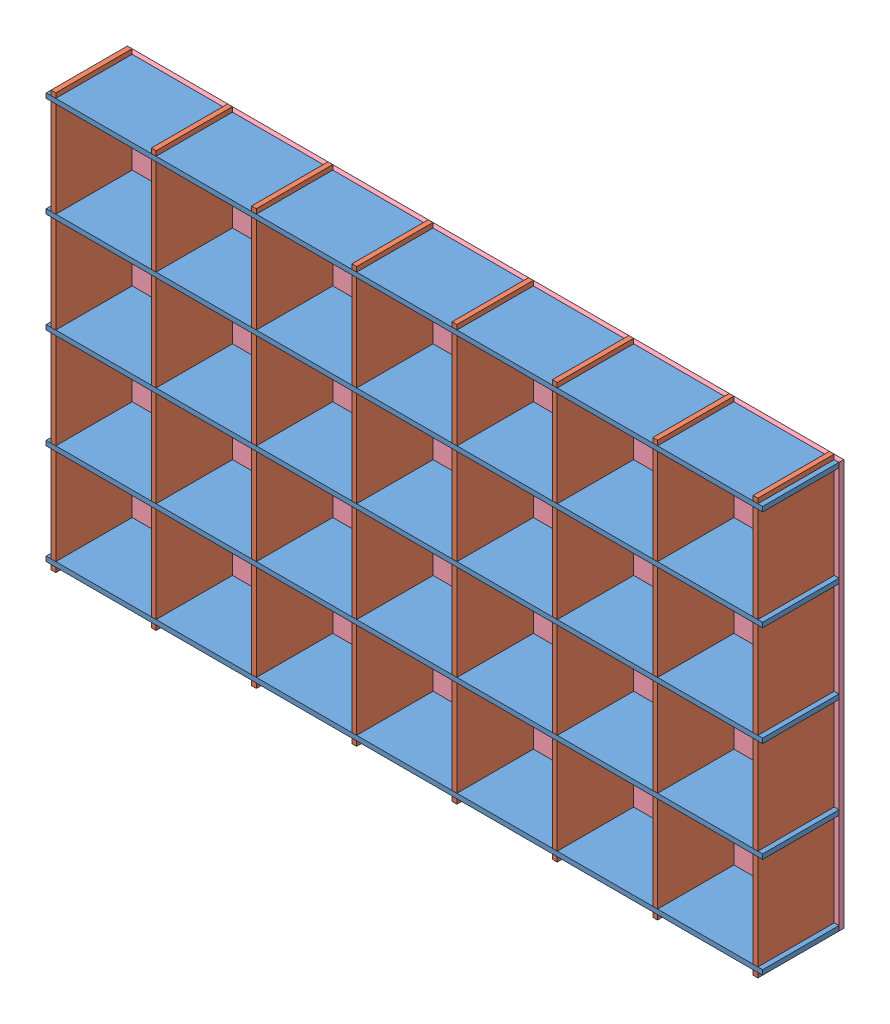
SolidWorks assembly Assem1.sldasm, configuration Default (file format 6000). Lengths in mm.
Overall size (952.5 552.45 107.95).
22 component instances, 4 part files, 3 mates.
Components (placement in the parent):
- shelves-1: shelves.SLDASM [Default] at (360.49 538.3645 700.4575) size (952.5 552.45 107.95)
  - Horizontal-6: Horizontal.SLDPRT [Default] at (-83.5049 678.0016 765.7569) size (952.5 6.35 101.6)
  - Vertical-9: Vertical.SLDPRT [Default] at (-77.1549 -293.5484 664.1569) x (0 1 0) z (1 0 0) size (552.45 101.6 6.35)
  - Vertical-10: Vertical.SLDPRT [Default] at (722.9451 -293.5484 664.1569) x (0 1 0) z (1 0 0) size (552.45 101.6 6.35)
  - Vertical-11: Vertical.SLDPRT [Default] at (456.2451 -293.5484 664.1569) x (0 1 0) z (1 0 0) size (552.45 101.6 6.35)
  - Vertical-12: Vertical.SLDPRT [Default] at (856.2951 -293.5484 664.1569) x (0 1 0) z (1 0 0) size (552.45 101.6 6.35)
  - Vertical-13: Vertical.SLDPRT [Default] at (322.8951 -293.5484 664.1569) x (0 1 0) z (1 0 0) size (552.45 101.6 6.35)
  - Vertical-14: Vertical.SLDPRT [Default] at (189.5451 -293.5484 664.1569) x (0 1 0) z (1 0 0) size (552.45 101.6 6.35)
  - Vertical-15: Vertical.SLDPRT [Default] at (56.1951 -293.5484 664.1569) x (0 1 0) z (1 0 0) size (552.45 101.6 6.35)
  - Vertical-16: Vertical.SLDPRT [Default] at (589.5951 -293.5484 664.1569) x (0 1 0) z (1 0 0) size (552.45 101.6 6.35)
  - Horizontal-7: Horizontal.SLDPRT [Default] at (-83.5049 144.6016 765.7569) size (952.5 6.35 101.6)
  - Horizontal-8: Horizontal.SLDPRT [Default] at (-83.5049 277.9516 765.7569) size (952.5 6.35 101.6)
  - Horizontal-9: Horizontal.SLDPRT [Default] at (-83.5049 411.3016 765.7569) size (952.5 6.35 101.6)
  - Horizontal-10: Horizontal.SLDPRT [Default] at (-83.5049 544.6516 765.7569) size (952.5 6.35 101.6)
  - little support-1: little support.SLDPRT [Default] at (646.7451 671.6515 673.6819) size (25.4 6.35 15.88)
  - little support-2: little support.SLDPRT [Default] at (780.0951 671.6516 673.6819) size (25.4 6.35 15.88)
  - little support-3: little support.SLDPRT [Default] at (246.6951 671.6516 673.6819) size (25.4 6.35 15.88)
  - little support-4: little support.SLDPRT [Default] at (380.0451 671.6515 673.6819) size (25.4 6.35 15.88)
  - little support-5: little support.SLDPRT [Default] at (513.3951 671.6515 673.6819) size (25.4 6.35 15.88)
  - little support-6: little support.SLDPRT [Default] at (113.3451 671.6516 673.6819) size (25.4 6.35 15.88)
  - little support-7: little support.SLDPRT [Default] at (-20.0049 671.6516 673.6819) size (25.4 6.35 15.88)
- complete back-1: complete back.SLDPRT [Default] at (276.9851 682.9661 1358.2644) size (952.5 539.75 6.35)
Mates (geometry in assembly coordinates):
- Coincident1: coincident: plane of shelves-1/Horizontal-6 through (1089.7851 1222.7161 1364.6144) normal (0 0 -1); plane of complete back-1 through (276.9851 682.9661 1364.6144) normal (0 0 1)
- Coincident2: coincident: plane of shelves-1/Horizontal-6 through (276.9851 1222.7161 1466.2144) normal (0 1 0); plane of complete back-1 through (276.9851 1222.7161 1364.6144) normal (0 1 0)
- Coincident3: coincident aligned: plane of shelves-1/Horizontal-6 through (1229.4851 1222.7161 1364.6144) normal (1 0 0); plane of complete back-1 through (1229.4851 682.9661 1364.6144) normal (1 0 0)
